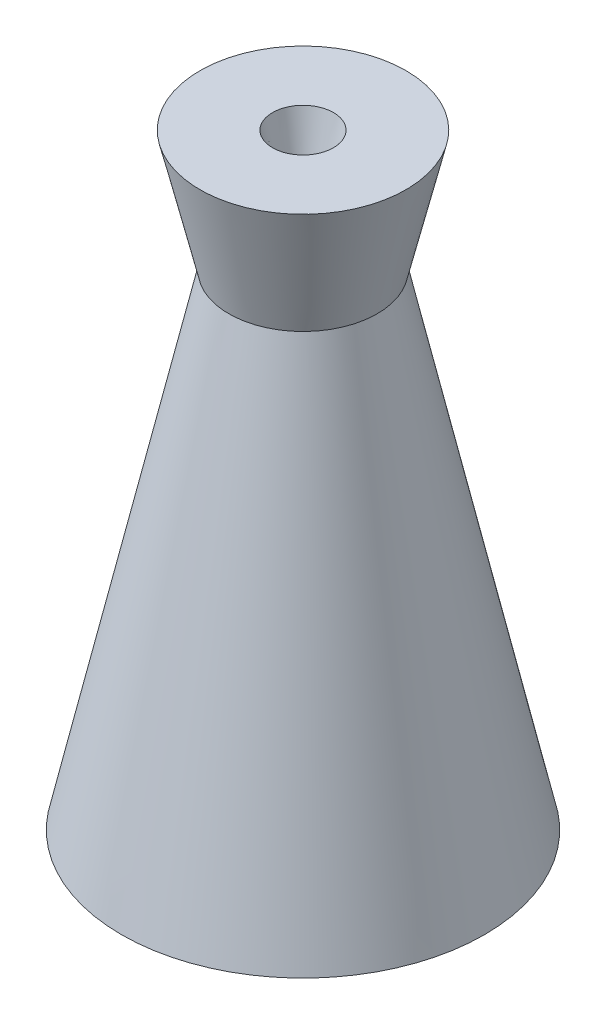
from build123d import *


with BuildPart() as part:
    # Sketch1 → Revolve2 (revolve)
    with BuildSketch(Plane.XY, mode=Mode.PRIVATE) as revolve2_sk:
        Polygon((23.495, 0), (38.1, 0), (15.573902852, 101.599451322), (21.636577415, 127.19232852), (6.396577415, 127.19232852), (0.333902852, 101.599451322), align=None)
    revolve(revolve2_sk.sketch.rotate(Axis((0, 0, 0), (0, 1, 0)), 90), axis=Axis((0, 0, 0), (0, 1, 0)))


solid = part.part
